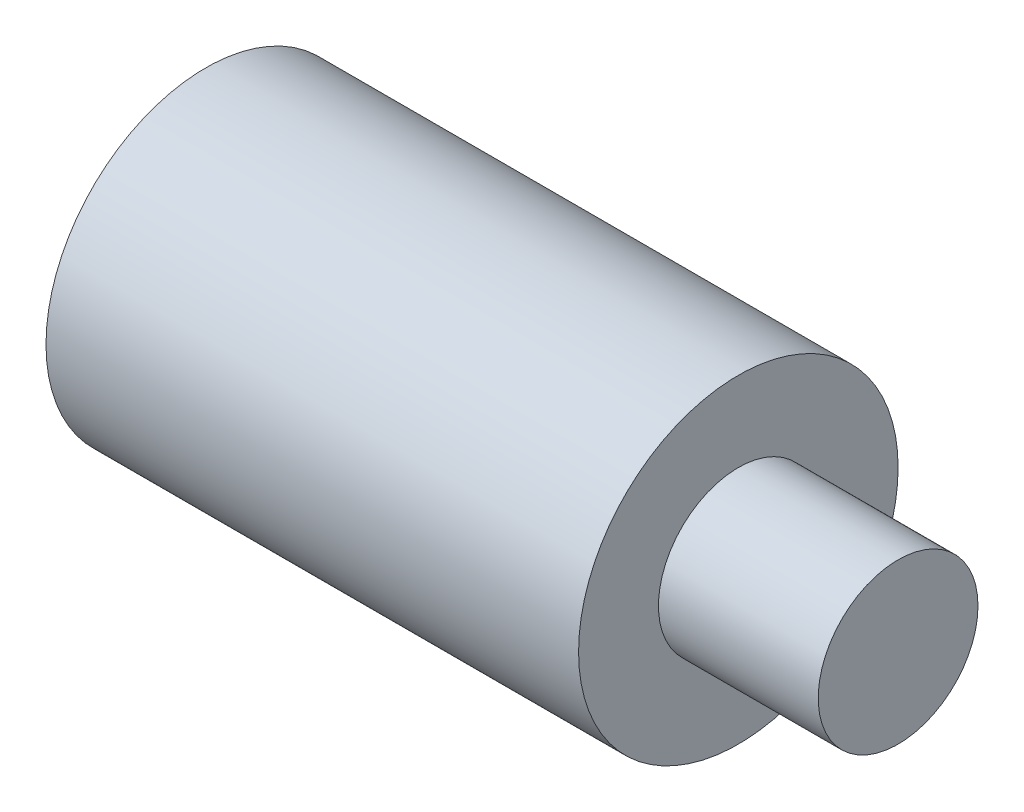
ISO-10303-21;
HEADER;
FILE_DESCRIPTION(('STEP AP214'),'2;1');
FILE_NAME('part.step','',(''),(''),'','','');
FILE_SCHEMA(('AUTOMOTIVE_DESIGN { 1 0 10303 214 1 1 1 1 }'));
ENDSEC;
DATA;
#1=APPLICATION_CONTEXT('core data for automotive mechanical design processes');
#2=APPLICATION_PROTOCOL_DEFINITION('international standard','automotive_design',2000,#1);
#3=PRODUCT_CONTEXT('',#1,'mechanical');
#4=PRODUCT('Part','Part','',(#3));
#5=PRODUCT_RELATED_PRODUCT_CATEGORY('part','',(#4));
#6=PRODUCT_DEFINITION_FORMATION('','',#4);
#7=PRODUCT_DEFINITION_CONTEXT('part definition',#1,'design');
#8=PRODUCT_DEFINITION('design','',#6,#7);
#9=PRODUCT_DEFINITION_SHAPE('','',#8);
#10=(LENGTH_UNIT() NAMED_UNIT(*) SI_UNIT(.MILLI.,.METRE.));
#11=(NAMED_UNIT(*) PLANE_ANGLE_UNIT() SI_UNIT($,.RADIAN.));
#12=(NAMED_UNIT(*) SI_UNIT($,.STERADIAN.) SOLID_ANGLE_UNIT());
#13=UNCERTAINTY_MEASURE_WITH_UNIT(LENGTH_MEASURE(1.E-05),#10,'distance_accuracy_value','');
#14=(GEOMETRIC_REPRESENTATION_CONTEXT(3) GLOBAL_UNCERTAINTY_ASSIGNED_CONTEXT((#13)) GLOBAL_UNIT_ASSIGNED_CONTEXT((#10,
#11,#12)) REPRESENTATION_CONTEXT('',''));
#15=CARTESIAN_POINT('',(0.,0.,0.));
#16=DIRECTION('',(0.,0.,1.));
#17=DIRECTION('',(1.,0.,0.));
#18=AXIS2_PLACEMENT_3D('',#15,#16,#17);
#19=CARTESIAN_POINT('',(50.,0.,0.));
#20=DIRECTION('',(-1.,0.,0.));
#21=DIRECTION('',(0.,0.,1.));
#22=AXIS2_PLACEMENT_3D('',#19,#20,#21);
#23=CYLINDRICAL_SURFACE('',#22,30.);
#24=CARTESIAN_POINT('',(50.,0.,0.));
#25=DIRECTION('',(1.,0.,0.));
#26=DIRECTION('',(0.,0.,-1.));
#27=AXIS2_PLACEMENT_3D('',#24,#25,#26);
#28=CIRCLE('',#27,30.);
#29=CARTESIAN_POINT('',(50.,0.,-30.));
#30=VERTEX_POINT('',#29);
#31=EDGE_CURVE('E54',#30,#30,#28,.T.);
#32=ORIENTED_EDGE('',*,*,#31,.F.);
#33=EDGE_LOOP('',(#32));
#34=FACE_BOUND('',#33,.T.);
#35=CARTESIAN_POINT('',(-50.,0.,0.));
#36=DIRECTION('',(1.,0.,0.));
#37=DIRECTION('',(0.,0.,-1.));
#38=AXIS2_PLACEMENT_3D('',#35,#36,#37);
#39=CIRCLE('',#38,30.);
#40=CARTESIAN_POINT('',(-50.,0.,-30.));
#41=VERTEX_POINT('',#40);
#42=EDGE_CURVE('E48',#41,#41,#39,.T.);
#43=ORIENTED_EDGE('',*,*,#42,.T.);
#44=EDGE_LOOP('',(#43));
#45=FACE_BOUND('',#44,.T.);
#46=ADVANCED_FACE('F45',(#34,#45),#23,.T.);
#47=CARTESIAN_POINT('',(50.,0.,0.));
#48=DIRECTION('',(1.,0.,0.));
#49=DIRECTION('',(0.,0.,-1.));
#50=AXIS2_PLACEMENT_3D('',#47,#48,#49);
#51=PLANE('',#50);
#52=CARTESIAN_POINT('',(50.,0.,0.));
#53=DIRECTION('',(1.,0.,0.));
#54=DIRECTION('',(0.,0.,-1.));
#55=AXIS2_PLACEMENT_3D('',#52,#53,#54);
#56=CIRCLE('',#55,15.);
#57=CARTESIAN_POINT('',(50.,0.,-15.));
#58=VERTEX_POINT('',#57);
#59=EDGE_CURVE('E11',#58,#58,#56,.T.);
#60=ORIENTED_EDGE('',*,*,#59,.F.);
#61=EDGE_LOOP('',(#60));
#62=FACE_BOUND('',#61,.T.);
#63=ORIENTED_EDGE('',*,*,#31,.T.);
#64=EDGE_LOOP('',(#63));
#65=FACE_BOUND('',#64,.T.);
#66=ADVANCED_FACE('F80',(#62,#65),#51,.T.);
#67=CARTESIAN_POINT('',(-50.,0.,0.));
#68=DIRECTION('',(1.,0.,0.));
#69=DIRECTION('',(0.,0.,-1.));
#70=AXIS2_PLACEMENT_3D('',#67,#68,#69);
#71=PLANE('',#70);
#72=ORIENTED_EDGE('',*,*,#42,.F.);
#73=EDGE_LOOP('',(#72));
#74=FACE_BOUND('',#73,.T.);
#75=ADVANCED_FACE('F77',(#74),#71,.F.);
#76=CARTESIAN_POINT('',(80.,0.,0.));
#77=DIRECTION('',(-1.,0.,0.));
#78=DIRECTION('',(0.,0.,1.));
#79=AXIS2_PLACEMENT_3D('',#76,#77,#78);
#80=CYLINDRICAL_SURFACE('',#79,15.);
#81=CARTESIAN_POINT('',(80.,0.,0.));
#82=DIRECTION('',(1.,0.,0.));
#83=DIRECTION('',(0.,0.,-1.));
#84=AXIS2_PLACEMENT_3D('',#81,#82,#83);
#85=CIRCLE('',#84,15.);
#86=CARTESIAN_POINT('',(80.,0.,-15.));
#87=VERTEX_POINT('',#86);
#88=EDGE_CURVE('E64',#87,#87,#85,.T.);
#89=ORIENTED_EDGE('',*,*,#88,.F.);
#90=EDGE_LOOP('',(#89));
#91=FACE_BOUND('',#90,.T.);
#92=ORIENTED_EDGE('',*,*,#59,.T.);
#93=EDGE_LOOP('',(#92));
#94=FACE_BOUND('',#93,.T.);
#95=ADVANCED_FACE('F79',(#91,#94),#80,.T.);
#96=CARTESIAN_POINT('',(80.,0.,0.));
#97=DIRECTION('',(1.,0.,0.));
#98=DIRECTION('',(0.,0.,-1.));
#99=AXIS2_PLACEMENT_3D('',#96,#97,#98);
#100=PLANE('',#99);
#101=ORIENTED_EDGE('',*,*,#88,.T.);
#102=EDGE_LOOP('',(#101));
#103=FACE_BOUND('',#102,.T.);
#104=ADVANCED_FACE('F85',(#103),#100,.T.);
#105=CLOSED_SHELL('',(#46,#66,#75,#95,#104));
#106=MANIFOLD_SOLID_BREP('B2',#105);
#107=ADVANCED_BREP_SHAPE_REPRESENTATION('',(#18,#106),#14);
#108=SHAPE_DEFINITION_REPRESENTATION(#9,#107);
ENDSEC;
END-ISO-10303-21;
